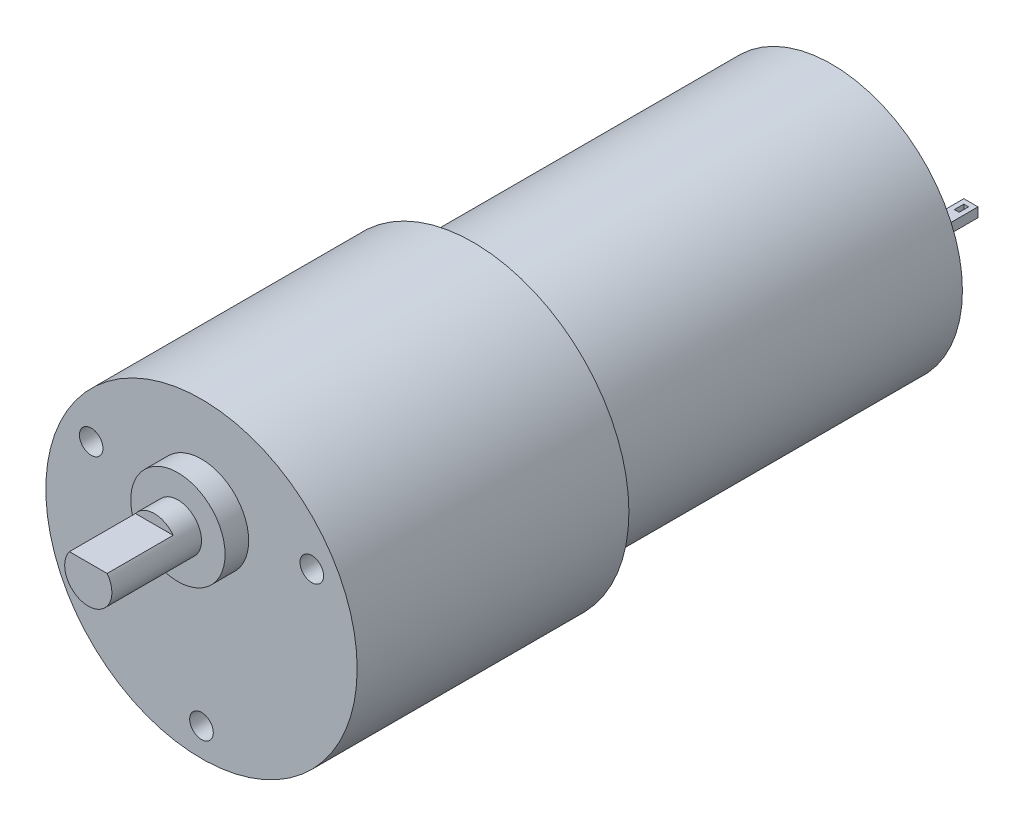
ISO-10303-21;
HEADER;
FILE_DESCRIPTION(('STEP AP214'),'2;1');
FILE_NAME('part.step','',(''),(''),'','','');
FILE_SCHEMA(('AUTOMOTIVE_DESIGN { 1 0 10303 214 1 1 1 1 }'));
ENDSEC;
DATA;
#1=APPLICATION_CONTEXT('core data for automotive mechanical design processes');
#2=APPLICATION_PROTOCOL_DEFINITION('international standard','automotive_design',2000,#1);
#3=PRODUCT_CONTEXT('',#1,'mechanical');
#4=PRODUCT('Part','Part','',(#3));
#5=PRODUCT_RELATED_PRODUCT_CATEGORY('part','',(#4));
#6=PRODUCT_DEFINITION_FORMATION('','',#4);
#7=PRODUCT_DEFINITION_CONTEXT('part definition',#1,'design');
#8=PRODUCT_DEFINITION('design','',#6,#7);
#9=PRODUCT_DEFINITION_SHAPE('','',#8);
#10=(LENGTH_UNIT() NAMED_UNIT(*) SI_UNIT(.MILLI.,.METRE.));
#11=(NAMED_UNIT(*) PLANE_ANGLE_UNIT() SI_UNIT($,.RADIAN.));
#12=(NAMED_UNIT(*) SI_UNIT($,.STERADIAN.) SOLID_ANGLE_UNIT());
#13=UNCERTAINTY_MEASURE_WITH_UNIT(LENGTH_MEASURE(1.E-05),#10,'distance_accuracy_value','');
#14=(GEOMETRIC_REPRESENTATION_CONTEXT(3) GLOBAL_UNCERTAINTY_ASSIGNED_CONTEXT((#13)) GLOBAL_UNIT_ASSIGNED_CONTEXT((#10,
#11,#12)) REPRESENTATION_CONTEXT('',''));
#15=CARTESIAN_POINT('',(0.,0.,0.));
#16=DIRECTION('',(0.,0.,1.));
#17=DIRECTION('',(1.,0.,0.));
#18=AXIS2_PLACEMENT_3D('',#15,#16,#17);
#19=CARTESIAN_POINT('',(0.,0.,0.));
#20=DIRECTION('',(0.,0.,1.));
#21=DIRECTION('',(1.,0.,0.));
#22=AXIS2_PLACEMENT_3D('',#19,#20,#21);
#23=PLANE('',#22);
#24=DIRECTION('',(0.,-1.,0.));
#25=VECTOR('',#24,1.);
#26=CARTESIAN_POINT('',(-7.50000000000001,0.500000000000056,0.));
#27=LINE('',#26,#25);
#28=CARTESIAN_POINT('',(-7.50000000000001,0.500000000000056,0.));
#29=VERTEX_POINT('',#28);
#30=CARTESIAN_POINT('',(-7.4999999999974,-0.499999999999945,0.));
#31=VERTEX_POINT('',#30);
#32=EDGE_CURVE('E406',#29,#31,#27,.T.);
#33=ORIENTED_EDGE('',*,*,#32,.T.);
#34=DIRECTION('',(1.,0.,0.));
#35=VECTOR('',#34,1.);
#36=CARTESIAN_POINT('',(-7.4999999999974,-0.499999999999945,0.));
#37=LINE('',#36,#35);
#38=CARTESIAN_POINT('',(-5.9999999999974,-0.499999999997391,0.));
#39=VERTEX_POINT('',#38);
#40=EDGE_CURVE('E461',#31,#39,#37,.T.);
#41=ORIENTED_EDGE('',*,*,#40,.T.);
#42=DIRECTION('',(0.,-1.,0.));
#43=VECTOR('',#42,1.);
#44=CARTESIAN_POINT('',(-6.00000000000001,0.500000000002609,0.));
#45=LINE('',#44,#43);
#46=CARTESIAN_POINT('',(-6.00000000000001,0.500000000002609,0.));
#47=VERTEX_POINT('',#46);
#48=EDGE_CURVE('E412',#47,#39,#45,.T.);
#49=ORIENTED_EDGE('',*,*,#48,.F.);
#50=DIRECTION('',(1.,0.,0.));
#51=VECTOR('',#50,1.);
#52=CARTESIAN_POINT('',(-7.50000000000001,0.500000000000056,0.));
#53=LINE('',#52,#51);
#54=EDGE_CURVE('E508',#29,#47,#53,.T.);
#55=ORIENTED_EDGE('',*,*,#54,.F.);
#56=EDGE_LOOP('',(#33,#41,#49,#55));
#57=FACE_BOUND('',#56,.T.);
#58=CARTESIAN_POINT('',(0.,0.,0.));
#59=DIRECTION('',(0.,0.,-1.));
#60=DIRECTION('',(-1.,0.,0.));
#61=AXIS2_PLACEMENT_3D('',#58,#59,#60);
#62=CIRCLE('',#61,5.);
#63=CARTESIAN_POINT('',(-5.,0.,0.));
#64=VERTEX_POINT('',#63);
#65=EDGE_CURVE('E60',#64,#64,#62,.T.);
#66=ORIENTED_EDGE('',*,*,#65,.F.);
#67=EDGE_LOOP('',(#66));
#68=FACE_BOUND('',#67,.T.);
#69=CARTESIAN_POINT('',(0.,0.,0.));
#70=DIRECTION('',(0.,0.,1.));
#71=DIRECTION('',(1.,0.,0.));
#72=AXIS2_PLACEMENT_3D('',#69,#70,#71);
#73=CIRCLE('',#72,13.85);
#74=CARTESIAN_POINT('',(13.85,1.80791986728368E-13,0.));
#75=VERTEX_POINT('',#74);
#76=EDGE_CURVE('E53',#75,#75,#73,.T.);
#77=ORIENTED_EDGE('',*,*,#76,.F.);
#78=EDGE_LOOP('',(#77));
#79=FACE_BOUND('',#78,.T.);
#80=DIRECTION('',(0.,-1.,0.));
#81=VECTOR('',#80,1.);
#82=CARTESIAN_POINT('',(7.50000000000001,0.500000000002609,0.));
#83=LINE('',#82,#81);
#84=CARTESIAN_POINT('',(7.50000000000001,0.500000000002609,0.));
#85=VERTEX_POINT('',#84);
#86=CARTESIAN_POINT('',(7.50000000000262,-0.499999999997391,0.));
#87=VERTEX_POINT('',#86);
#88=EDGE_CURVE('E76',#85,#87,#83,.T.);
#89=ORIENTED_EDGE('',*,*,#88,.F.);
#90=DIRECTION('',(1.,0.,0.));
#91=VECTOR('',#90,1.);
#92=CARTESIAN_POINT('',(7.50000000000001,0.500000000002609,0.));
#93=LINE('',#92,#91);
#94=CARTESIAN_POINT('',(6.00000000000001,0.500000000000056,0.));
#95=VERTEX_POINT('',#94);
#96=EDGE_CURVE('E488',#95,#85,#93,.T.);
#97=ORIENTED_EDGE('',*,*,#96,.F.);
#98=DIRECTION('',(0.,-1.,0.));
#99=VECTOR('',#98,1.);
#100=CARTESIAN_POINT('',(6.00000000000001,0.500000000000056,0.));
#101=LINE('',#100,#99);
#102=CARTESIAN_POINT('',(6.00000000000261,-0.499999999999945,0.));
#103=VERTEX_POINT('',#102);
#104=EDGE_CURVE('E245',#95,#103,#101,.T.);
#105=ORIENTED_EDGE('',*,*,#104,.T.);
#106=DIRECTION('',(1.,0.,0.));
#107=VECTOR('',#106,1.);
#108=CARTESIAN_POINT('',(7.50000000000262,-0.499999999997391,0.));
#109=LINE('',#108,#107);
#110=EDGE_CURVE('E246',#103,#87,#109,.T.);
#111=ORIENTED_EDGE('',*,*,#110,.T.);
#112=EDGE_LOOP('',(#89,#97,#105,#111));
#113=FACE_BOUND('',#112,.T.);
#114=ADVANCED_FACE('F49',(#57,#68,#79,#113),#23,.F.);
#115=CARTESIAN_POINT('',(0.,0.,38.));
#116=DIRECTION('',(0.,0.,-1.));
#117=DIRECTION('',(-1.,0.,0.));
#118=AXIS2_PLACEMENT_3D('',#115,#116,#117);
#119=CYLINDRICAL_SURFACE('',#118,13.85);
#120=CARTESIAN_POINT('',(0.,0.,38.));
#121=DIRECTION('',(0.,0.,1.));
#122=DIRECTION('',(1.,0.,0.));
#123=AXIS2_PLACEMENT_3D('',#120,#121,#122);
#124=CIRCLE('',#123,13.85);
#125=CARTESIAN_POINT('',(13.85,1.80791986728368E-13,38.));
#126=VERTEX_POINT('',#125);
#127=EDGE_CURVE('E539',#126,#126,#124,.T.);
#128=ORIENTED_EDGE('',*,*,#127,.F.);
#129=EDGE_LOOP('',(#128));
#130=FACE_BOUND('',#129,.T.);
#131=ORIENTED_EDGE('',*,*,#76,.T.);
#132=EDGE_LOOP('',(#131));
#133=FACE_BOUND('',#132,.T.);
#134=ADVANCED_FACE('F51',(#130,#133),#119,.T.);
#135=CARTESIAN_POINT('',(1.33226762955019E-12,5.21804821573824E-12,-2.80000000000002));
#136=DIRECTION('',(0.,0.,1.));
#137=DIRECTION('',(1.,0.,0.));
#138=AXIS2_PLACEMENT_3D('',#135,#136,#137);
#139=CYLINDRICAL_SURFACE('',#138,5.);
#140=CARTESIAN_POINT('',(1.33226762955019E-12,5.21804821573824E-12,-2.80000000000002));
#141=DIRECTION('',(0.,0.,-1.));
#142=DIRECTION('',(-1.,0.,0.));
#143=AXIS2_PLACEMENT_3D('',#140,#141,#142);
#144=CIRCLE('',#143,5.);
#145=CARTESIAN_POINT('',(-4.99999999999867,5.15278035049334E-12,-2.80000000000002));
#146=VERTEX_POINT('',#145);
#147=EDGE_CURVE('E411',#146,#146,#144,.T.);
#148=ORIENTED_EDGE('',*,*,#147,.F.);
#149=EDGE_LOOP('',(#148));
#150=FACE_BOUND('',#149,.T.);
#151=ORIENTED_EDGE('',*,*,#65,.T.);
#152=EDGE_LOOP('',(#151));
#153=FACE_BOUND('',#152,.T.);
#154=ADVANCED_FACE('F764',(#150,#153),#139,.T.);
#155=CARTESIAN_POINT('',(1.33226762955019E-12,5.21804821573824E-12,-2.80000000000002));
#156=DIRECTION('',(0.,0.,-1.));
#157=DIRECTION('',(-1.,0.,0.));
#158=AXIS2_PLACEMENT_3D('',#155,#156,#157);
#159=PLANE('',#158);
#160=ORIENTED_EDGE('',*,*,#147,.T.);
#161=EDGE_LOOP('',(#160));
#162=FACE_BOUND('',#161,.T.);
#163=ADVANCED_FACE('F753',(#162),#159,.T.);
#164=CARTESIAN_POINT('',(0.,0.499999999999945,0.));
#165=DIRECTION('',(0.,-1.,0.));
#166=DIRECTION('',(0.,0.,-1.));
#167=AXIS2_PLACEMENT_3D('',#164,#165,#166);
#168=PLANE('',#167);
#169=DIRECTION('',(0.,0.,1.));
#170=VECTOR('',#169,1.);
#171=CARTESIAN_POINT('',(-7.50000000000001,0.500000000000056,0.));
#172=LINE('',#171,#170);
#173=CARTESIAN_POINT('',(-7.50000000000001,0.500000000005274,-8.00000000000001));
#174=VERTEX_POINT('',#173);
#175=EDGE_CURVE('E382',#174,#29,#172,.T.);
#176=ORIENTED_EDGE('',*,*,#175,.T.);
#177=ORIENTED_EDGE('',*,*,#54,.T.);
#178=DIRECTION('',(0.,0.,-1.));
#179=VECTOR('',#178,1.);
#180=CARTESIAN_POINT('',(-6.00000000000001,0.500000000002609,0.));
#181=LINE('',#180,#179);
#182=CARTESIAN_POINT('',(-6.00000000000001,0.500000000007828,-8.00000000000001));
#183=VERTEX_POINT('',#182);
#184=EDGE_CURVE('E453',#47,#183,#181,.T.);
#185=ORIENTED_EDGE('',*,*,#184,.T.);
#186=DIRECTION('',(-1.,0.,0.));
#187=VECTOR('',#186,1.);
#188=CARTESIAN_POINT('',(-7.50000000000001,0.500000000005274,-8.00000000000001));
#189=LINE('',#188,#187);
#190=EDGE_CURVE('E437',#183,#174,#189,.T.);
#191=ORIENTED_EDGE('',*,*,#190,.T.);
#192=EDGE_LOOP('',(#176,#177,#185,#191));
#193=FACE_BOUND('',#192,.T.);
#194=DIRECTION('',(0.,0.,1.));
#195=VECTOR('',#194,1.);
#196=CARTESIAN_POINT('',(-7.00000000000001,0.500000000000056,-7.50000000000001));
#197=LINE('',#196,#195);
#198=CARTESIAN_POINT('',(-7.00000000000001,0.500000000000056,-7.50000000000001));
#199=VERTEX_POINT('',#198);
#200=CARTESIAN_POINT('',(-7.00000000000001,0.500000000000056,-6.50000000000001));
#201=VERTEX_POINT('',#200);
#202=EDGE_CURVE('E363',#199,#201,#197,.T.);
#203=ORIENTED_EDGE('',*,*,#202,.F.);
#204=DIRECTION('',(-1.,0.,0.));
#205=VECTOR('',#204,1.);
#206=CARTESIAN_POINT('',(-7.00000000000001,0.500000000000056,-7.50000000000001));
#207=LINE('',#206,#205);
#208=CARTESIAN_POINT('',(-6.50000000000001,0.500000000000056,-7.50000000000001));
#209=VERTEX_POINT('',#208);
#210=EDGE_CURVE('E398',#209,#199,#207,.T.);
#211=ORIENTED_EDGE('',*,*,#210,.F.);
#212=DIRECTION('',(0.,0.,-1.));
#213=VECTOR('',#212,1.);
#214=CARTESIAN_POINT('',(-6.50000000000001,0.500000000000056,-7.50000000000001));
#215=LINE('',#214,#213);
#216=CARTESIAN_POINT('',(-6.50000000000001,0.500000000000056,-6.50000000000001));
#217=VERTEX_POINT('',#216);
#218=EDGE_CURVE('E394',#217,#209,#215,.T.);
#219=ORIENTED_EDGE('',*,*,#218,.F.);
#220=DIRECTION('',(1.,0.,0.));
#221=VECTOR('',#220,1.);
#222=CARTESIAN_POINT('',(-7.00000000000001,0.500000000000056,-6.50000000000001));
#223=LINE('',#222,#221);
#224=EDGE_CURVE('E390',#201,#217,#223,.T.);
#225=ORIENTED_EDGE('',*,*,#224,.F.);
#226=EDGE_LOOP('',(#203,#211,#219,#225));
#227=FACE_BOUND('',#226,.T.);
#228=ADVANCED_FACE('F519',(#193,#227),#168,.F.);
#229=CARTESIAN_POINT('',(2.60902410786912E-12,-0.499999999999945,0.));
#230=DIRECTION('',(0.,-1.,0.));
#231=DIRECTION('',(0.,0.,-1.));
#232=AXIS2_PLACEMENT_3D('',#229,#230,#231);
#233=PLANE('',#232);
#234=DIRECTION('',(0.,0.,1.));
#235=VECTOR('',#234,1.);
#236=CARTESIAN_POINT('',(-7.4999999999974,-0.499999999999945,0.));
#237=LINE('',#236,#235);
#238=CARTESIAN_POINT('',(-7.49999999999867,-0.499999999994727,-8.00000000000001));
#239=VERTEX_POINT('',#238);
#240=EDGE_CURVE('E381',#239,#31,#237,.T.);
#241=ORIENTED_EDGE('',*,*,#240,.F.);
#242=DIRECTION('',(-1.,0.,0.));
#243=VECTOR('',#242,1.);
#244=CARTESIAN_POINT('',(-7.49999999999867,-0.499999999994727,-8.00000000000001));
#245=LINE('',#244,#243);
#246=CARTESIAN_POINT('',(-5.99999999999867,-0.499999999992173,-8.00000000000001));
#247=VERTEX_POINT('',#246);
#248=EDGE_CURVE('E426',#247,#239,#245,.T.);
#249=ORIENTED_EDGE('',*,*,#248,.F.);
#250=DIRECTION('',(0.,0.,-1.));
#251=VECTOR('',#250,1.);
#252=CARTESIAN_POINT('',(-5.9999999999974,-0.499999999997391,0.));
#253=LINE('',#252,#251);
#254=EDGE_CURVE('E430',#39,#247,#253,.T.);
#255=ORIENTED_EDGE('',*,*,#254,.F.);
#256=ORIENTED_EDGE('',*,*,#40,.F.);
#257=EDGE_LOOP('',(#241,#249,#255,#256));
#258=FACE_BOUND('',#257,.T.);
#259=DIRECTION('',(-1.,0.,0.));
#260=VECTOR('',#259,1.);
#261=CARTESIAN_POINT('',(-7.00000000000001,-0.499999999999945,-7.50000000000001));
#262=LINE('',#261,#260);
#263=CARTESIAN_POINT('',(-6.50000000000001,-0.499999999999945,-7.50000000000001));
#264=VERTEX_POINT('',#263);
#265=CARTESIAN_POINT('',(-7.00000000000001,-0.499999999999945,-7.50000000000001));
#266=VERTEX_POINT('',#265);
#267=EDGE_CURVE('E355',#264,#266,#262,.T.);
#268=ORIENTED_EDGE('',*,*,#267,.T.);
#269=DIRECTION('',(0.,0.,1.));
#270=VECTOR('',#269,1.);
#271=CARTESIAN_POINT('',(-7.00000000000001,-0.499999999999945,-7.50000000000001));
#272=LINE('',#271,#270);
#273=CARTESIAN_POINT('',(-7.00000000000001,-0.499999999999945,-6.50000000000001));
#274=VERTEX_POINT('',#273);
#275=EDGE_CURVE('E1037',#266,#274,#272,.T.);
#276=ORIENTED_EDGE('',*,*,#275,.T.);
#277=DIRECTION('',(1.,0.,0.));
#278=VECTOR('',#277,1.);
#279=CARTESIAN_POINT('',(-7.00000000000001,-0.499999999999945,-6.50000000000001));
#280=LINE('',#279,#278);
#281=CARTESIAN_POINT('',(-6.50000000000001,-0.499999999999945,-6.50000000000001));
#282=VERTEX_POINT('',#281);
#283=EDGE_CURVE('E356',#274,#282,#280,.T.);
#284=ORIENTED_EDGE('',*,*,#283,.T.);
#285=DIRECTION('',(0.,0.,-1.));
#286=VECTOR('',#285,1.);
#287=CARTESIAN_POINT('',(-6.50000000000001,-0.499999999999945,-7.50000000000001));
#288=LINE('',#287,#286);
#289=EDGE_CURVE('E349',#282,#264,#288,.T.);
#290=ORIENTED_EDGE('',*,*,#289,.T.);
#291=EDGE_LOOP('',(#268,#276,#284,#290));
#292=FACE_BOUND('',#291,.T.);
#293=ADVANCED_FACE('F459',(#258,#292),#233,.T.);
#294=CARTESIAN_POINT('',(-7.50000000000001,0.500000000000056,0.));
#295=DIRECTION('',(1.,0.,0.));
#296=DIRECTION('',(0.,0.,-1.));
#297=AXIS2_PLACEMENT_3D('',#294,#295,#296);
#298=PLANE('',#297);
#299=ORIENTED_EDGE('',*,*,#240,.T.);
#300=ORIENTED_EDGE('',*,*,#32,.F.);
#301=ORIENTED_EDGE('',*,*,#175,.F.);
#302=DIRECTION('',(0.,-1.,0.));
#303=VECTOR('',#302,1.);
#304=CARTESIAN_POINT('',(-7.50000000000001,0.500000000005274,-8.00000000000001));
#305=LINE('',#304,#303);
#306=EDGE_CURVE('E432',#174,#239,#305,.T.);
#307=ORIENTED_EDGE('',*,*,#306,.T.);
#308=EDGE_LOOP('',(#299,#300,#301,#307));
#309=FACE_BOUND('',#308,.T.);
#310=ADVANCED_FACE('F525',(#309),#298,.F.);
#311=CARTESIAN_POINT('',(-6.00000000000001,0.500000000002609,0.));
#312=DIRECTION('',(-1.,0.,0.));
#313=DIRECTION('',(0.,0.,1.));
#314=AXIS2_PLACEMENT_3D('',#311,#312,#313);
#315=PLANE('',#314);
#316=ORIENTED_EDGE('',*,*,#254,.T.);
#317=DIRECTION('',(0.,-1.,0.));
#318=VECTOR('',#317,1.);
#319=CARTESIAN_POINT('',(-6.00000000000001,0.500000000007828,-8.00000000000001));
#320=LINE('',#319,#318);
#321=EDGE_CURVE('E436',#183,#247,#320,.T.);
#322=ORIENTED_EDGE('',*,*,#321,.F.);
#323=ORIENTED_EDGE('',*,*,#184,.F.);
#324=ORIENTED_EDGE('',*,*,#48,.T.);
#325=EDGE_LOOP('',(#316,#322,#323,#324));
#326=FACE_BOUND('',#325,.T.);
#327=ADVANCED_FACE('F452',(#326),#315,.F.);
#328=CARTESIAN_POINT('',(-7.50000000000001,0.500000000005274,-8.00000000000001));
#329=DIRECTION('',(0.,0.,1.));
#330=DIRECTION('',(1.,0.,0.));
#331=AXIS2_PLACEMENT_3D('',#328,#329,#330);
#332=PLANE('',#331);
#333=ORIENTED_EDGE('',*,*,#248,.T.);
#334=ORIENTED_EDGE('',*,*,#306,.F.);
#335=ORIENTED_EDGE('',*,*,#190,.F.);
#336=ORIENTED_EDGE('',*,*,#321,.T.);
#337=EDGE_LOOP('',(#333,#334,#335,#336));
#338=FACE_BOUND('',#337,.T.);
#339=ADVANCED_FACE('F523',(#338),#332,.F.);
#340=CARTESIAN_POINT('',(-7.00000000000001,0.500000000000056,-7.50000000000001));
#341=DIRECTION('',(1.,0.,0.));
#342=DIRECTION('',(0.,0.,-1.));
#343=AXIS2_PLACEMENT_3D('',#340,#341,#342);
#344=PLANE('',#343);
#345=ORIENTED_EDGE('',*,*,#275,.F.);
#346=DIRECTION('',(0.,-1.,0.));
#347=VECTOR('',#346,1.);
#348=CARTESIAN_POINT('',(-7.00000000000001,0.500000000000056,-7.50000000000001));
#349=LINE('',#348,#347);
#350=EDGE_CURVE('E364',#199,#266,#349,.T.);
#351=ORIENTED_EDGE('',*,*,#350,.F.);
#352=ORIENTED_EDGE('',*,*,#202,.T.);
#353=DIRECTION('',(0.,-1.,0.));
#354=VECTOR('',#353,1.);
#355=CARTESIAN_POINT('',(-7.00000000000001,0.500000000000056,-6.50000000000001));
#356=LINE('',#355,#354);
#357=EDGE_CURVE('E376',#201,#274,#356,.T.);
#358=ORIENTED_EDGE('',*,*,#357,.T.);
#359=EDGE_LOOP('',(#345,#351,#352,#358));
#360=FACE_BOUND('',#359,.T.);
#361=ADVANCED_FACE('F746',(#360),#344,.T.);
#362=CARTESIAN_POINT('',(-7.00000000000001,0.500000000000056,-6.50000000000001));
#363=DIRECTION('',(0.,0.,-1.));
#364=DIRECTION('',(-1.,0.,0.));
#365=AXIS2_PLACEMENT_3D('',#362,#363,#364);
#366=PLANE('',#365);
#367=ORIENTED_EDGE('',*,*,#283,.F.);
#368=ORIENTED_EDGE('',*,*,#357,.F.);
#369=ORIENTED_EDGE('',*,*,#224,.T.);
#370=DIRECTION('',(0.,-1.,0.));
#371=VECTOR('',#370,1.);
#372=CARTESIAN_POINT('',(-6.50000000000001,0.500000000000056,-6.50000000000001));
#373=LINE('',#372,#371);
#374=EDGE_CURVE('E372',#217,#282,#373,.T.);
#375=ORIENTED_EDGE('',*,*,#374,.T.);
#376=EDGE_LOOP('',(#367,#368,#369,#375));
#377=FACE_BOUND('',#376,.T.);
#378=ADVANCED_FACE('F742',(#377),#366,.T.);
#379=CARTESIAN_POINT('',(-6.50000000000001,0.500000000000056,-7.50000000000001));
#380=DIRECTION('',(-1.,0.,0.));
#381=DIRECTION('',(0.,0.,1.));
#382=AXIS2_PLACEMENT_3D('',#379,#380,#381);
#383=PLANE('',#382);
#384=ORIENTED_EDGE('',*,*,#289,.F.);
#385=ORIENTED_EDGE('',*,*,#374,.F.);
#386=ORIENTED_EDGE('',*,*,#218,.T.);
#387=DIRECTION('',(0.,-1.,0.));
#388=VECTOR('',#387,1.);
#389=CARTESIAN_POINT('',(-6.50000000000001,0.500000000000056,-7.50000000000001));
#390=LINE('',#389,#388);
#391=EDGE_CURVE('E369',#209,#264,#390,.T.);
#392=ORIENTED_EDGE('',*,*,#391,.T.);
#393=EDGE_LOOP('',(#384,#385,#386,#392));
#394=FACE_BOUND('',#393,.T.);
#395=ADVANCED_FACE('F738',(#394),#383,.T.);
#396=CARTESIAN_POINT('',(-7.00000000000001,0.500000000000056,-7.50000000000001));
#397=DIRECTION('',(0.,0.,1.));
#398=DIRECTION('',(1.,0.,0.));
#399=AXIS2_PLACEMENT_3D('',#396,#397,#398);
#400=PLANE('',#399);
#401=ORIENTED_EDGE('',*,*,#267,.F.);
#402=ORIENTED_EDGE('',*,*,#391,.F.);
#403=ORIENTED_EDGE('',*,*,#210,.T.);
#404=ORIENTED_EDGE('',*,*,#350,.T.);
#405=EDGE_LOOP('',(#401,#402,#403,#404));
#406=FACE_BOUND('',#405,.T.);
#407=ADVANCED_FACE('F728',(#406),#400,.T.);
#408=CARTESIAN_POINT('',(0.,0.499999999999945,0.));
#409=DIRECTION('',(0.,-1.,0.));
#410=DIRECTION('',(0.,0.,-1.));
#411=AXIS2_PLACEMENT_3D('',#408,#409,#410);
#412=PLANE('',#411);
#413=ORIENTED_EDGE('',*,*,#96,.T.);
#414=DIRECTION('',(0.,0.,-1.));
#415=VECTOR('',#414,1.);
#416=CARTESIAN_POINT('',(7.50000000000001,0.500000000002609,0.));
#417=LINE('',#416,#415);
#418=CARTESIAN_POINT('',(7.50000000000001,0.500000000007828,-8.00000000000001));
#419=VERTEX_POINT('',#418);
#420=EDGE_CURVE('E238',#85,#419,#417,.T.);
#421=ORIENTED_EDGE('',*,*,#420,.T.);
#422=DIRECTION('',(-1.,0.,0.));
#423=VECTOR('',#422,1.);
#424=CARTESIAN_POINT('',(7.50000000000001,0.500000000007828,-8.00000000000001));
#425=LINE('',#424,#423);
#426=CARTESIAN_POINT('',(6.00000000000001,0.500000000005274,-8.00000000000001));
#427=VERTEX_POINT('',#426);
#428=EDGE_CURVE('E232',#419,#427,#425,.T.);
#429=ORIENTED_EDGE('',*,*,#428,.T.);
#430=DIRECTION('',(0.,0.,1.));
#431=VECTOR('',#430,1.);
#432=CARTESIAN_POINT('',(6.00000000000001,0.500000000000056,0.));
#433=LINE('',#432,#431);
#434=EDGE_CURVE('E237',#427,#95,#433,.T.);
#435=ORIENTED_EDGE('',*,*,#434,.T.);
#436=EDGE_LOOP('',(#413,#421,#429,#435));
#437=FACE_BOUND('',#436,.T.);
#438=DIRECTION('',(-1.,0.,0.));
#439=VECTOR('',#438,1.);
#440=CARTESIAN_POINT('',(7.00000000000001,0.500000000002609,-7.50000000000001));
#441=LINE('',#440,#439);
#442=CARTESIAN_POINT('',(7.00000000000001,0.500000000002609,-7.50000000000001));
#443=VERTEX_POINT('',#442);
#444=CARTESIAN_POINT('',(6.50000000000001,0.499999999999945,-7.50000000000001));
#445=VERTEX_POINT('',#444);
#446=EDGE_CURVE('E557',#443,#445,#441,.T.);
#447=ORIENTED_EDGE('',*,*,#446,.F.);
#448=DIRECTION('',(0.,0.,-1.));
#449=VECTOR('',#448,1.);
#450=CARTESIAN_POINT('',(7.00000000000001,0.500000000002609,-7.50000000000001));
#451=LINE('',#450,#449);
#452=CARTESIAN_POINT('',(7.00000000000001,0.500000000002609,-6.50000000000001));
#453=VERTEX_POINT('',#452);
#454=EDGE_CURVE('E578',#453,#443,#451,.T.);
#455=ORIENTED_EDGE('',*,*,#454,.F.);
#456=DIRECTION('',(1.,0.,0.));
#457=VECTOR('',#456,1.);
#458=CARTESIAN_POINT('',(7.00000000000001,0.500000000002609,-6.50000000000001));
#459=LINE('',#458,#457);
#460=CARTESIAN_POINT('',(6.50000000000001,0.499999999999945,-6.50000000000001));
#461=VERTEX_POINT('',#460);
#462=EDGE_CURVE('E564',#461,#453,#459,.T.);
#463=ORIENTED_EDGE('',*,*,#462,.F.);
#464=DIRECTION('',(0.,0.,1.));
#465=VECTOR('',#464,1.);
#466=CARTESIAN_POINT('',(6.50000000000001,0.499999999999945,-7.50000000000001));
#467=LINE('',#466,#465);
#468=EDGE_CURVE('E561',#445,#461,#467,.T.);
#469=ORIENTED_EDGE('',*,*,#468,.F.);
#470=EDGE_LOOP('',(#447,#455,#463,#469));
#471=FACE_BOUND('',#470,.T.);
#472=ADVANCED_FACE('F599',(#437,#471),#412,.F.);
#473=CARTESIAN_POINT('',(2.60902410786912E-12,-0.499999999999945,0.));
#474=DIRECTION('',(0.,-1.,0.));
#475=DIRECTION('',(0.,0.,-1.));
#476=AXIS2_PLACEMENT_3D('',#473,#474,#475);
#477=PLANE('',#476);
#478=ORIENTED_EDGE('',*,*,#110,.F.);
#479=DIRECTION('',(0.,0.,1.));
#480=VECTOR('',#479,1.);
#481=CARTESIAN_POINT('',(6.00000000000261,-0.499999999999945,0.));
#482=LINE('',#481,#480);
#483=CARTESIAN_POINT('',(6.00000000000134,-0.499999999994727,-8.00000000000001));
#484=VERTEX_POINT('',#483);
#485=EDGE_CURVE('E482',#484,#103,#482,.T.);
#486=ORIENTED_EDGE('',*,*,#485,.F.);
#487=DIRECTION('',(-1.,0.,0.));
#488=VECTOR('',#487,1.);
#489=CARTESIAN_POINT('',(7.50000000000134,-0.499999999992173,-8.00000000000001));
#490=LINE('',#489,#488);
#491=CARTESIAN_POINT('',(7.50000000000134,-0.499999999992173,-8.00000000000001));
#492=VERTEX_POINT('',#491);
#493=EDGE_CURVE('E479',#492,#484,#490,.T.);
#494=ORIENTED_EDGE('',*,*,#493,.F.);
#495=DIRECTION('',(0.,0.,-1.));
#496=VECTOR('',#495,1.);
#497=CARTESIAN_POINT('',(7.50000000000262,-0.499999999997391,0.));
#498=LINE('',#497,#496);
#499=EDGE_CURVE('E483',#87,#492,#498,.T.);
#500=ORIENTED_EDGE('',*,*,#499,.F.);
#501=EDGE_LOOP('',(#478,#486,#494,#500));
#502=FACE_BOUND('',#501,.T.);
#503=DIRECTION('',(0.,0.,-1.));
#504=VECTOR('',#503,1.);
#505=CARTESIAN_POINT('',(7.00000000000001,-0.499999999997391,-7.50000000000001));
#506=LINE('',#505,#504);
#507=CARTESIAN_POINT('',(7.00000000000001,-0.499999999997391,-6.50000000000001));
#508=VERTEX_POINT('',#507);
#509=CARTESIAN_POINT('',(7.00000000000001,-0.499999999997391,-7.50000000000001));
#510=VERTEX_POINT('',#509);
#511=EDGE_CURVE('E291',#508,#510,#506,.T.);
#512=ORIENTED_EDGE('',*,*,#511,.T.);
#513=DIRECTION('',(-1.,0.,0.));
#514=VECTOR('',#513,1.);
#515=CARTESIAN_POINT('',(7.00000000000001,-0.499999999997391,-7.50000000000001));
#516=LINE('',#515,#514);
#517=CARTESIAN_POINT('',(6.50000000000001,-0.500000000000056,-7.50000000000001));
#518=VERTEX_POINT('',#517);
#519=EDGE_CURVE('E284',#510,#518,#516,.T.);
#520=ORIENTED_EDGE('',*,*,#519,.T.);
#521=DIRECTION('',(0.,0.,1.));
#522=VECTOR('',#521,1.);
#523=CARTESIAN_POINT('',(6.50000000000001,-0.500000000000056,-7.50000000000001));
#524=LINE('',#523,#522);
#525=CARTESIAN_POINT('',(6.50000000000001,-0.500000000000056,-6.50000000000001));
#526=VERTEX_POINT('',#525);
#527=EDGE_CURVE('E277',#518,#526,#524,.T.);
#528=ORIENTED_EDGE('',*,*,#527,.T.);
#529=DIRECTION('',(1.,0.,0.));
#530=VECTOR('',#529,1.);
#531=CARTESIAN_POINT('',(7.00000000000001,-0.499999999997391,-6.50000000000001));
#532=LINE('',#531,#530);
#533=EDGE_CURVE('E283',#526,#508,#532,.T.);
#534=ORIENTED_EDGE('',*,*,#533,.T.);
#535=EDGE_LOOP('',(#512,#520,#528,#534));
#536=FACE_BOUND('',#535,.T.);
#537=ADVANCED_FACE('F623',(#502,#536),#477,.T.);
#538=CARTESIAN_POINT('',(7.50000000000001,0.500000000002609,0.));
#539=DIRECTION('',(-1.,0.,0.));
#540=DIRECTION('',(0.,0.,1.));
#541=AXIS2_PLACEMENT_3D('',#538,#539,#540);
#542=PLANE('',#541);
#543=ORIENTED_EDGE('',*,*,#499,.T.);
#544=DIRECTION('',(0.,-1.,0.));
#545=VECTOR('',#544,1.);
#546=CARTESIAN_POINT('',(7.50000000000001,0.500000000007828,-8.00000000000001));
#547=LINE('',#546,#545);
#548=EDGE_CURVE('E259',#419,#492,#547,.T.);
#549=ORIENTED_EDGE('',*,*,#548,.F.);
#550=ORIENTED_EDGE('',*,*,#420,.F.);
#551=ORIENTED_EDGE('',*,*,#88,.T.);
#552=EDGE_LOOP('',(#543,#549,#550,#551));
#553=FACE_BOUND('',#552,.T.);
#554=ADVANCED_FACE('F616',(#553),#542,.F.);
#555=CARTESIAN_POINT('',(7.50000000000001,0.500000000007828,-8.00000000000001));
#556=DIRECTION('',(0.,0.,1.));
#557=DIRECTION('',(1.,0.,0.));
#558=AXIS2_PLACEMENT_3D('',#555,#556,#557);
#559=PLANE('',#558);
#560=ORIENTED_EDGE('',*,*,#493,.T.);
#561=DIRECTION('',(0.,-1.,0.));
#562=VECTOR('',#561,1.);
#563=CARTESIAN_POINT('',(6.00000000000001,0.500000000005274,-8.00000000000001));
#564=LINE('',#563,#562);
#565=EDGE_CURVE('E253',#427,#484,#564,.T.);
#566=ORIENTED_EDGE('',*,*,#565,.F.);
#567=ORIENTED_EDGE('',*,*,#428,.F.);
#568=ORIENTED_EDGE('',*,*,#548,.T.);
#569=EDGE_LOOP('',(#560,#566,#567,#568));
#570=FACE_BOUND('',#569,.T.);
#571=ADVANCED_FACE('F621',(#570),#559,.F.);
#572=CARTESIAN_POINT('',(6.00000000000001,0.500000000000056,0.));
#573=DIRECTION('',(1.,0.,0.));
#574=DIRECTION('',(0.,0.,-1.));
#575=AXIS2_PLACEMENT_3D('',#572,#573,#574);
#576=PLANE('',#575);
#577=ORIENTED_EDGE('',*,*,#485,.T.);
#578=ORIENTED_EDGE('',*,*,#104,.F.);
#579=ORIENTED_EDGE('',*,*,#434,.F.);
#580=ORIENTED_EDGE('',*,*,#565,.T.);
#581=EDGE_LOOP('',(#577,#578,#579,#580));
#582=FACE_BOUND('',#581,.T.);
#583=ADVANCED_FACE('F726',(#582),#576,.F.);
#584=CARTESIAN_POINT('',(7.00000000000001,0.500000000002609,-7.50000000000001));
#585=DIRECTION('',(0.,0.,1.));
#586=DIRECTION('',(1.,0.,0.));
#587=AXIS2_PLACEMENT_3D('',#584,#585,#586);
#588=PLANE('',#587);
#589=ORIENTED_EDGE('',*,*,#519,.F.);
#590=DIRECTION('',(0.,-1.,0.));
#591=VECTOR('',#590,1.);
#592=CARTESIAN_POINT('',(7.00000000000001,0.500000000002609,-7.50000000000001));
#593=LINE('',#592,#591);
#594=EDGE_CURVE('E576',#443,#510,#593,.T.);
#595=ORIENTED_EDGE('',*,*,#594,.F.);
#596=ORIENTED_EDGE('',*,*,#446,.T.);
#597=DIRECTION('',(0.,-1.,0.));
#598=VECTOR('',#597,1.);
#599=CARTESIAN_POINT('',(6.50000000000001,0.499999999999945,-7.50000000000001));
#600=LINE('',#599,#598);
#601=EDGE_CURVE('E500',#445,#518,#600,.T.);
#602=ORIENTED_EDGE('',*,*,#601,.T.);
#603=EDGE_LOOP('',(#589,#595,#596,#602));
#604=FACE_BOUND('',#603,.T.);
#605=ADVANCED_FACE('F603',(#604),#588,.T.);
#606=CARTESIAN_POINT('',(6.50000000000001,0.499999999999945,-7.50000000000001));
#607=DIRECTION('',(1.,0.,0.));
#608=DIRECTION('',(0.,0.,-1.));
#609=AXIS2_PLACEMENT_3D('',#606,#607,#608);
#610=PLANE('',#609);
#611=ORIENTED_EDGE('',*,*,#527,.F.);
#612=ORIENTED_EDGE('',*,*,#601,.F.);
#613=ORIENTED_EDGE('',*,*,#468,.T.);
#614=DIRECTION('',(0.,-1.,0.));
#615=VECTOR('',#614,1.);
#616=CARTESIAN_POINT('',(6.50000000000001,0.499999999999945,-6.50000000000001));
#617=LINE('',#616,#615);
#618=EDGE_CURVE('E569',#461,#526,#617,.T.);
#619=ORIENTED_EDGE('',*,*,#618,.T.);
#620=EDGE_LOOP('',(#611,#612,#613,#619));
#621=FACE_BOUND('',#620,.T.);
#622=ADVANCED_FACE('F606',(#621),#610,.T.);
#623=CARTESIAN_POINT('',(7.00000000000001,0.500000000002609,-6.50000000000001));
#624=DIRECTION('',(0.,0.,-1.));
#625=DIRECTION('',(-1.,0.,0.));
#626=AXIS2_PLACEMENT_3D('',#623,#624,#625);
#627=PLANE('',#626);
#628=ORIENTED_EDGE('',*,*,#533,.F.);
#629=ORIENTED_EDGE('',*,*,#618,.F.);
#630=ORIENTED_EDGE('',*,*,#462,.T.);
#631=DIRECTION('',(0.,-1.,0.));
#632=VECTOR('',#631,1.);
#633=CARTESIAN_POINT('',(7.00000000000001,0.500000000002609,-6.50000000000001));
#634=LINE('',#633,#632);
#635=EDGE_CURVE('E573',#453,#508,#634,.T.);
#636=ORIENTED_EDGE('',*,*,#635,.T.);
#637=EDGE_LOOP('',(#628,#629,#630,#636));
#638=FACE_BOUND('',#637,.T.);
#639=ADVANCED_FACE('F594',(#638),#627,.T.);
#640=CARTESIAN_POINT('',(7.00000000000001,0.500000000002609,-7.50000000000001));
#641=DIRECTION('',(-1.,0.,0.));
#642=DIRECTION('',(0.,0.,1.));
#643=AXIS2_PLACEMENT_3D('',#640,#641,#642);
#644=PLANE('',#643);
#645=ORIENTED_EDGE('',*,*,#511,.F.);
#646=ORIENTED_EDGE('',*,*,#635,.F.);
#647=ORIENTED_EDGE('',*,*,#454,.T.);
#648=ORIENTED_EDGE('',*,*,#594,.T.);
#649=EDGE_LOOP('',(#645,#646,#647,#648));
#650=FACE_BOUND('',#649,.T.);
#651=ADVANCED_FACE('F716',(#650),#644,.T.);
#652=CARTESIAN_POINT('',(0.,5.21804821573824E-12,66.8));
#653=DIRECTION('',(0.,0.,-1.));
#654=DIRECTION('',(-1.,0.,0.));
#655=AXIS2_PLACEMENT_3D('',#652,#653,#654);
#656=CYLINDRICAL_SURFACE('',#655,16.5);
#657=CARTESIAN_POINT('',(0.,5.21804821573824E-12,66.8));
#658=DIRECTION('',(0.,0.,1.));
#659=DIRECTION('',(1.,0.,0.));
#660=AXIS2_PLACEMENT_3D('',#657,#658,#659);
#661=CIRCLE('',#660,16.5);
#662=CARTESIAN_POINT('',(16.5,5.4334321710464E-12,66.8));
#663=VERTEX_POINT('',#662);
#664=EDGE_CURVE('E554',#663,#663,#661,.T.);
#665=ORIENTED_EDGE('',*,*,#664,.F.);
#666=EDGE_LOOP('',(#665));
#667=FACE_BOUND('',#666,.T.);
#668=CARTESIAN_POINT('',(0.,0.,38.));
#669=DIRECTION('',(0.,0.,1.));
#670=DIRECTION('',(1.,0.,0.));
#671=AXIS2_PLACEMENT_3D('',#668,#669,#670);
#672=CIRCLE('',#671,16.5);
#673=CARTESIAN_POINT('',(16.5,2.15383955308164E-13,38.));
#674=VERTEX_POINT('',#673);
#675=EDGE_CURVE('E549',#674,#674,#672,.T.);
#676=ORIENTED_EDGE('',*,*,#675,.T.);
#677=EDGE_LOOP('',(#676));
#678=FACE_BOUND('',#677,.T.);
#679=ADVANCED_FACE('F710',(#667,#678),#656,.T.);
#680=CARTESIAN_POINT('',(0.,5.21804821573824E-12,66.8));
#681=DIRECTION('',(0.,0.,1.));
#682=DIRECTION('',(1.,0.,0.));
#683=AXIS2_PLACEMENT_3D('',#680,#681,#682);
#684=PLANE('',#683);
#685=CARTESIAN_POINT('',(0.,6.00000000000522,66.8));
#686=DIRECTION('',(0.,0.,1.));
#687=DIRECTION('',(1.,0.,0.));
#688=AXIS2_PLACEMENT_3D('',#685,#686,#687);
#689=CIRCLE('',#688,5.);
#690=CARTESIAN_POINT('',(5.,6.00000000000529,66.8));
#691=VERTEX_POINT('',#690);
#692=EDGE_CURVE('E308',#691,#691,#689,.T.);
#693=ORIENTED_EDGE('',*,*,#692,.F.);
#694=EDGE_LOOP('',(#693));
#695=FACE_BOUND('',#694,.T.);
#696=CARTESIAN_POINT('',(0.,-13.4999999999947,66.8));
#697=DIRECTION('',(0.,0.,1.));
#698=DIRECTION('',(1.,0.,0.));
#699=AXIS2_PLACEMENT_3D('',#696,#697,#698);
#700=CIRCLE('',#699,1.24999999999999);
#701=CARTESIAN_POINT('',(1.24999999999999,-13.4999999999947,66.8));
#702=VERTEX_POINT('',#701);
#703=EDGE_CURVE('E307',#702,#702,#700,.T.);
#704=ORIENTED_EDGE('',*,*,#703,.F.);
#705=EDGE_LOOP('',(#704));
#706=FACE_BOUND('',#705,.T.);
#707=CARTESIAN_POINT('',(-11.6913429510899,6.75000000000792,66.8));
#708=DIRECTION('',(0.,0.,1.));
#709=DIRECTION('',(1.,0.,0.));
#710=AXIS2_PLACEMENT_3D('',#707,#708,#709);
#711=CIRCLE('',#710,1.24999999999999);
#712=CARTESIAN_POINT('',(-10.4413429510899,6.75000000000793,66.8));
#713=VERTEX_POINT('',#712);
#714=EDGE_CURVE('E326',#713,#713,#711,.T.);
#715=ORIENTED_EDGE('',*,*,#714,.F.);
#716=EDGE_LOOP('',(#715));
#717=FACE_BOUND('',#716,.T.);
#718=CARTESIAN_POINT('',(11.69134295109,6.75000000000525,66.7999999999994));
#719=DIRECTION('',(0.,0.,1.));
#720=DIRECTION('',(1.,0.,0.));
#721=AXIS2_PLACEMENT_3D('',#718,#719,#720);
#722=CIRCLE('',#721,1.24999999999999);
#723=CARTESIAN_POINT('',(12.94134295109,6.75000000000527,66.7999999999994));
#724=VERTEX_POINT('',#723);
#725=EDGE_CURVE('E337',#724,#724,#722,.T.);
#726=ORIENTED_EDGE('',*,*,#725,.F.);
#727=EDGE_LOOP('',(#726));
#728=FACE_BOUND('',#727,.T.);
#729=ORIENTED_EDGE('',*,*,#664,.T.);
#730=EDGE_LOOP('',(#729));
#731=FACE_BOUND('',#730,.T.);
#732=ADVANCED_FACE('F707',(#695,#706,#717,#728,#731),#684,.T.);
#733=CARTESIAN_POINT('',(0.,0.,38.));
#734=DIRECTION('',(0.,0.,1.));
#735=DIRECTION('',(1.,0.,0.));
#736=AXIS2_PLACEMENT_3D('',#733,#734,#735);
#737=PLANE('',#736);
#738=ORIENTED_EDGE('',*,*,#127,.T.);
#739=EDGE_LOOP('',(#738));
#740=FACE_BOUND('',#739,.T.);
#741=ORIENTED_EDGE('',*,*,#675,.F.);
#742=EDGE_LOOP('',(#741));
#743=FACE_BOUND('',#742,.T.);
#744=ADVANCED_FACE('F705',(#740,#743),#737,.F.);
#745=CARTESIAN_POINT('',(11.69134295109,6.75000000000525,59.0510757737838));
#746=DIRECTION('',(0.,0.,1.));
#747=DIRECTION('',(1.,0.,0.));
#748=AXIS2_PLACEMENT_3D('',#745,#746,#747);
#749=CONICAL_SURFACE('',#748,1.25,1.02974425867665);
#750=CARTESIAN_POINT('',(11.69134295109,6.75000000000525,58.2999999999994));
#751=VERTEX_POINT('',#750);
#752=VERTEX_LOOP('',#751);
#753=FACE_BOUND('',#752,.T.);
#754=CARTESIAN_POINT('',(11.69134295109,6.75000000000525,59.0510757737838));
#755=DIRECTION('',(0.,0.,1.));
#756=DIRECTION('',(1.,0.,0.));
#757=AXIS2_PLACEMENT_3D('',#754,#755,#756);
#758=CIRCLE('',#757,1.25);
#759=CARTESIAN_POINT('',(12.94134295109,6.75000000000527,59.0510757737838));
#760=VERTEX_POINT('',#759);
#761=EDGE_CURVE('E555',#760,#760,#758,.T.);
#762=ORIENTED_EDGE('',*,*,#761,.T.);
#763=EDGE_LOOP('',(#762));
#764=FACE_BOUND('',#763,.T.);
#765=ADVANCED_FACE('F701',(#753,#764),#749,.F.);
#766=CARTESIAN_POINT('',(11.69134295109,6.75000000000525,66.7999999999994));
#767=DIRECTION('',(0.,0.,1.));
#768=DIRECTION('',(1.,0.,0.));
#769=AXIS2_PLACEMENT_3D('',#766,#767,#768);
#770=CYLINDRICAL_SURFACE('',#769,1.24999999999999);
#771=ORIENTED_EDGE('',*,*,#761,.F.);
#772=EDGE_LOOP('',(#771));
#773=FACE_BOUND('',#772,.T.);
#774=ORIENTED_EDGE('',*,*,#725,.T.);
#775=EDGE_LOOP('',(#774));
#776=FACE_BOUND('',#775,.T.);
#777=ADVANCED_FACE('F697',(#773,#776),#770,.F.);
#778=CARTESIAN_POINT('',(-11.6913429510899,6.75000000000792,59.0510757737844));
#779=DIRECTION('',(0.,0.,1.));
#780=DIRECTION('',(1.,0.,0.));
#781=AXIS2_PLACEMENT_3D('',#778,#779,#780);
#782=CONICAL_SURFACE('',#781,1.25,1.02974425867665);
#783=CARTESIAN_POINT('',(-11.6913429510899,6.75000000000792,58.3));
#784=VERTEX_POINT('',#783);
#785=VERTEX_LOOP('',#784);
#786=FACE_BOUND('',#785,.T.);
#787=CARTESIAN_POINT('',(-11.6913429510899,6.75000000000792,59.0510757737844));
#788=DIRECTION('',(0.,0.,1.));
#789=DIRECTION('',(1.,0.,0.));
#790=AXIS2_PLACEMENT_3D('',#787,#788,#789);
#791=CIRCLE('',#790,1.25);
#792=CARTESIAN_POINT('',(-10.4413429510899,6.75000000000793,59.0510757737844));
#793=VERTEX_POINT('',#792);
#794=EDGE_CURVE('E331',#793,#793,#791,.T.);
#795=ORIENTED_EDGE('',*,*,#794,.T.);
#796=EDGE_LOOP('',(#795));
#797=FACE_BOUND('',#796,.T.);
#798=ADVANCED_FACE('F693',(#786,#797),#782,.F.);
#799=CARTESIAN_POINT('',(-11.6913429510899,6.75000000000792,66.8));
#800=DIRECTION('',(0.,0.,1.));
#801=DIRECTION('',(1.,0.,0.));
#802=AXIS2_PLACEMENT_3D('',#799,#800,#801);
#803=CYLINDRICAL_SURFACE('',#802,1.24999999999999);
#804=ORIENTED_EDGE('',*,*,#794,.F.);
#805=EDGE_LOOP('',(#804));
#806=FACE_BOUND('',#805,.T.);
#807=ORIENTED_EDGE('',*,*,#714,.T.);
#808=EDGE_LOOP('',(#807));
#809=FACE_BOUND('',#808,.T.);
#810=ADVANCED_FACE('F689',(#806,#809),#803,.F.);
#811=CARTESIAN_POINT('',(0.,-13.4999999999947,59.0510757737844));
#812=DIRECTION('',(0.,0.,1.));
#813=DIRECTION('',(1.,0.,0.));
#814=AXIS2_PLACEMENT_3D('',#811,#812,#813);
#815=CONICAL_SURFACE('',#814,1.25,1.02974425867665);
#816=CARTESIAN_POINT('',(0.,-13.4999999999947,58.3));
#817=VERTEX_POINT('',#816);
#818=VERTEX_LOOP('',#817);
#819=FACE_BOUND('',#818,.T.);
#820=CARTESIAN_POINT('',(0.,-13.4999999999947,59.0510757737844));
#821=DIRECTION('',(0.,0.,1.));
#822=DIRECTION('',(1.,0.,0.));
#823=AXIS2_PLACEMENT_3D('',#820,#821,#822);
#824=CIRCLE('',#823,1.25);
#825=CARTESIAN_POINT('',(1.25,-13.4999999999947,59.0510757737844));
#826=VERTEX_POINT('',#825);
#827=EDGE_CURVE('E332',#826,#826,#824,.T.);
#828=ORIENTED_EDGE('',*,*,#827,.T.);
#829=EDGE_LOOP('',(#828));
#830=FACE_BOUND('',#829,.T.);
#831=ADVANCED_FACE('F685',(#819,#830),#815,.F.);
#832=CARTESIAN_POINT('',(0.,-13.4999999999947,66.8));
#833=DIRECTION('',(0.,0.,1.));
#834=DIRECTION('',(1.,0.,0.));
#835=AXIS2_PLACEMENT_3D('',#832,#833,#834);
#836=CYLINDRICAL_SURFACE('',#835,1.24999999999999);
#837=ORIENTED_EDGE('',*,*,#827,.F.);
#838=EDGE_LOOP('',(#837));
#839=FACE_BOUND('',#838,.T.);
#840=ORIENTED_EDGE('',*,*,#703,.T.);
#841=EDGE_LOOP('',(#840));
#842=FACE_BOUND('',#841,.T.);
#843=ADVANCED_FACE('F681',(#839,#842),#836,.F.);
#844=CARTESIAN_POINT('',(1.33226762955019E-12,6.00000000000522,69.3));
#845=DIRECTION('',(0.,0.,-1.));
#846=DIRECTION('',(-1.,0.,0.));
#847=AXIS2_PLACEMENT_3D('',#844,#845,#846);
#848=CYLINDRICAL_SURFACE('',#847,5.);
#849=CARTESIAN_POINT('',(1.33226762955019E-12,6.00000000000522,69.3));
#850=DIRECTION('',(0.,0.,1.));
#851=DIRECTION('',(1.,0.,0.));
#852=AXIS2_PLACEMENT_3D('',#849,#850,#851);
#853=CIRCLE('',#852,5.);
#854=CARTESIAN_POINT('',(5.00000000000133,6.00000000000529,69.3));
#855=VERTEX_POINT('',#854);
#856=EDGE_CURVE('E302',#855,#855,#853,.T.);
#857=ORIENTED_EDGE('',*,*,#856,.F.);
#858=EDGE_LOOP('',(#857));
#859=FACE_BOUND('',#858,.T.);
#860=ORIENTED_EDGE('',*,*,#692,.T.);
#861=EDGE_LOOP('',(#860));
#862=FACE_BOUND('',#861,.T.);
#863=ADVANCED_FACE('F677',(#859,#862),#848,.T.);
#864=CARTESIAN_POINT('',(1.33226762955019E-12,6.00000000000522,69.3));
#865=DIRECTION('',(0.,0.,1.));
#866=DIRECTION('',(1.,0.,0.));
#867=AXIS2_PLACEMENT_3D('',#864,#865,#866);
#868=PLANE('',#867);
#869=CARTESIAN_POINT('',(1.33226762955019E-12,6.00000000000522,69.3));
#870=DIRECTION('',(0.,0.,1.));
#871=DIRECTION('',(1.,0.,0.));
#872=AXIS2_PLACEMENT_3D('',#869,#870,#871);
#873=CIRCLE('',#872,2.5);
#874=CARTESIAN_POINT('',(2.50000000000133,6.00000000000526,69.3));
#875=VERTEX_POINT('',#874);
#876=EDGE_CURVE('E12',#875,#875,#873,.T.);
#877=ORIENTED_EDGE('',*,*,#876,.F.);
#878=EDGE_LOOP('',(#877));
#879=FACE_BOUND('',#878,.T.);
#880=ORIENTED_EDGE('',*,*,#856,.T.);
#881=EDGE_LOOP('',(#880));
#882=FACE_BOUND('',#881,.T.);
#883=ADVANCED_FACE('F671',(#879,#882),#868,.T.);
#884=CARTESIAN_POINT('',(0.,6.00000000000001,78.8));
#885=DIRECTION('',(0.,0.,-1.));
#886=DIRECTION('',(-1.,0.,0.));
#887=AXIS2_PLACEMENT_3D('',#884,#885,#886);
#888=CYLINDRICAL_SURFACE('',#887,2.5);
#889=CARTESIAN_POINT('',(0.,6.00000000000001,78.8));
#890=DIRECTION('',(0.,0.,1.));
#891=DIRECTION('',(1.,0.,0.));
#892=AXIS2_PLACEMENT_3D('',#889,#890,#891);
#893=CIRCLE('',#892,2.5);
#894=CARTESIAN_POINT('',(-2.,7.50000000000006,78.8));
#895=VERTEX_POINT('',#894);
#896=CARTESIAN_POINT('',(2.,7.50000000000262,78.8));
#897=VERTEX_POINT('',#896);
#898=EDGE_CURVE('E204',#895,#897,#893,.T.);
#899=ORIENTED_EDGE('',*,*,#898,.F.);
#900=DIRECTION('',(0.,0.,1.));
#901=VECTOR('',#900,1.);
#902=CARTESIAN_POINT('',(-2.,7.50000000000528,71.8));
#903=LINE('',#902,#901);
#904=CARTESIAN_POINT('',(-2.,7.50000000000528,71.8));
#905=VERTEX_POINT('',#904);
#906=EDGE_CURVE('E68',#905,#895,#903,.T.);
#907=ORIENTED_EDGE('',*,*,#906,.F.);
#908=CARTESIAN_POINT('',(0.,6.00000000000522,71.8));
#909=DIRECTION('',(0.,0.,1.));
#910=DIRECTION('',(-1.,0.,0.));
#911=AXIS2_PLACEMENT_3D('',#908,#909,#910);
#912=CIRCLE('',#911,2.5);
#913=CARTESIAN_POINT('',(2.,7.50000000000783,71.8));
#914=VERTEX_POINT('',#913);
#915=EDGE_CURVE('E188',#914,#905,#912,.T.);
#916=ORIENTED_EDGE('',*,*,#915,.F.);
#917=DIRECTION('',(0.,0.,1.));
#918=VECTOR('',#917,1.);
#919=CARTESIAN_POINT('',(2.,7.50000000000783,71.8));
#920=LINE('',#919,#918);
#921=EDGE_CURVE('E197',#914,#897,#920,.T.);
#922=ORIENTED_EDGE('',*,*,#921,.T.);
#923=EDGE_LOOP('',(#899,#907,#916,#922));
#924=FACE_BOUND('',#923,.T.);
#925=ORIENTED_EDGE('',*,*,#876,.T.);
#926=EDGE_LOOP('',(#925));
#927=FACE_BOUND('',#926,.T.);
#928=ADVANCED_FACE('F201',(#924,#927),#888,.T.);
#929=CARTESIAN_POINT('',(0.,6.00000000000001,78.8));
#930=DIRECTION('',(0.,0.,1.));
#931=DIRECTION('',(1.,0.,0.));
#932=AXIS2_PLACEMENT_3D('',#929,#930,#931);
#933=PLANE('',#932);
#934=DIRECTION('',(1.,0.,0.));
#935=VECTOR('',#934,1.);
#936=CARTESIAN_POINT('',(-2.,7.50000000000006,78.8));
#937=LINE('',#936,#935);
#938=EDGE_CURVE('E194',#895,#897,#937,.T.);
#939=ORIENTED_EDGE('',*,*,#938,.F.);
#940=ORIENTED_EDGE('',*,*,#898,.T.);
#941=EDGE_LOOP('',(#939,#940));
#942=FACE_BOUND('',#941,.T.);
#943=ADVANCED_FACE('F659',(#942),#933,.T.);
#944=CARTESIAN_POINT('',(-2.,7.50000000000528,71.8));
#945=DIRECTION('',(0.,-1.,0.));
#946=DIRECTION('',(0.,0.,-1.));
#947=AXIS2_PLACEMENT_3D('',#944,#945,#946);
#948=PLANE('',#947);
#949=ORIENTED_EDGE('',*,*,#938,.T.);
#950=ORIENTED_EDGE('',*,*,#921,.F.);
#951=DIRECTION('',(1.,0.,0.));
#952=VECTOR('',#951,1.);
#953=CARTESIAN_POINT('',(-2.,7.50000000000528,71.8));
#954=LINE('',#953,#952);
#955=EDGE_CURVE('E190',#905,#914,#954,.T.);
#956=ORIENTED_EDGE('',*,*,#955,.F.);
#957=ORIENTED_EDGE('',*,*,#906,.T.);
#958=EDGE_LOOP('',(#949,#950,#956,#957));
#959=FACE_BOUND('',#958,.T.);
#960=ADVANCED_FACE('F196',(#959),#948,.F.);
#961=CARTESIAN_POINT('',(0.,6.00000000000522,71.8));
#962=DIRECTION('',(0.,0.,-1.));
#963=DIRECTION('',(-1.,0.,0.));
#964=AXIS2_PLACEMENT_3D('',#961,#962,#963);
#965=PLANE('',#964);
#966=ORIENTED_EDGE('',*,*,#915,.T.);
#967=ORIENTED_EDGE('',*,*,#955,.T.);
#968=EDGE_LOOP('',(#966,#967));
#969=FACE_BOUND('',#968,.T.);
#970=ADVANCED_FACE('F189',(#969),#965,.F.);
#971=CLOSED_SHELL('',(#114,#134,#154,#163,#228,#293,#310,#327,#339,#361,#378,#395,#407,#472,
#537,#554,#571,#583,#605,#622,#639,#651,#679,#732,#744,#765,#777,#798,#810,#831,#843,#863,#883,
#928,#943,#960,#970));
#972=MANIFOLD_SOLID_BREP('B2',#971);
#973=ADVANCED_BREP_SHAPE_REPRESENTATION('',(#18,#972),#14);
#974=SHAPE_DEFINITION_REPRESENTATION(#9,#973);
ENDSEC;
END-ISO-10303-21;
